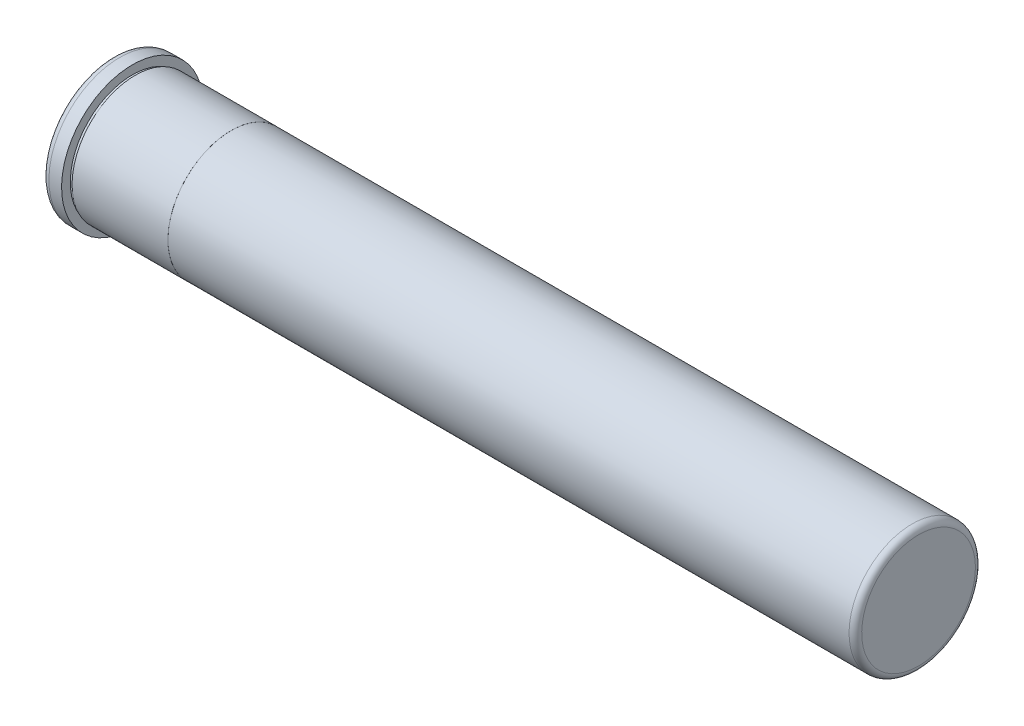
from build123d import *


with BuildPart() as part:
    # Sketch1 → Revolve1 (revolve)
    with BuildSketch(Plane.XY, mode=Mode.PRIVATE) as revolve1_sk:
        with BuildLine():
            Line((-3.1877, 0), (-3.1877, 25.6032))
            ThreePointArc((-3.1877, 25.6032), (-2.354477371, 27.614777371), (-0.3429, 28.448))
            Line((-0.3429, 28.448), (4.7498, 28.448))
            Line((4.7498, 28.448), (4.7498, 24.947245))
            Line((4.7498, 24.947245), (5.931516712, 24.947245))
            Line((5.931516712, 24.947245), (5.931516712, 25.4127))
            Line((5.931516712, 25.4127), (44.4373, 25.4127))
            Line((44.4373, 25.4127), (44.4373, 25.3873))
            Line((44.4373, 25.3873), (318.1223, 25.3873))
            ThreePointArc((318.1223, 25.3873), (319.918351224, 24.643351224), (320.6623, 22.8473))
            Line((320.6623, 22.8473), (320.6623, 0))
            Line((320.6623, 0), (-3.1877, 0))
        make_face()
    revolve(revolve1_sk.sketch.rotate(Axis((320.6623, 0, 0), (-1, 0, 0)), 180), axis=Axis((320.6623, 0, 0), (-1, 0, 0)))


solid = part.part
